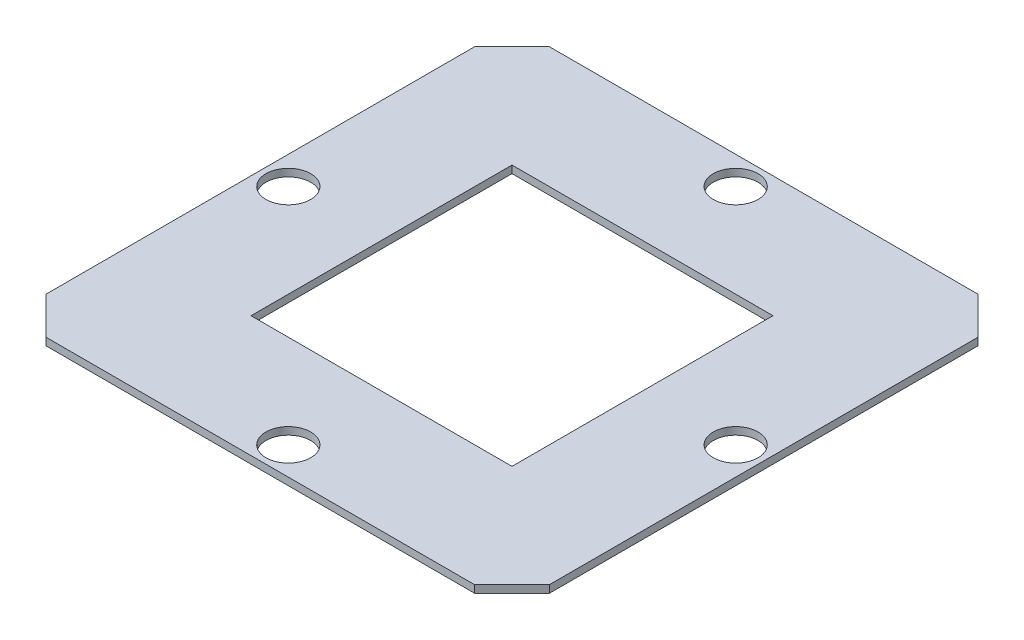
from build123d import *

# Parameters (mm, degrees)
SKETCH1_W          = 135
SKETCH1_H          = 135
EXTRUDE1_DEPTH     = 2
SKETCH2_R          = 6
CUT_EXTRUDE1_DEPTH = 96.480364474
CHAMFER1_SIZE      = 10
CUT_EXTRUDE2_REACH = 97.48
SKETCH3_W          = 70
SKETCH3_H          = 70


with BuildPart() as part:
    # Sketch1 → Extrude1 (new body)
    with BuildSketch(Plane(origin=(0, 0, 0), x_dir=(1, 0, 0), z_dir=(0, 1, 0))):
        Rectangle(SKETCH1_W, SKETCH1_H)
    extrude(amount=EXTRUDE1_DEPTH)

    # Sketch2 → Cut-Extrude1 (cut, through all)
    with BuildSketch(Plane(origin=(0, 2, 0), x_dir=(1, 0, 0), z_dir=(0, 1, 0))):
        with Locations(Location((0, 60, 0), (0, 0, 270))):
            Circle(SKETCH2_R)
        with Locations(Location((60, 0, 0), (0, 0, 270))):
            Circle(SKETCH2_R)
        with Locations(Location((0, -60, 0), (0, 0, 270))):
            Circle(SKETCH2_R)
        with Locations(Location((-60, 0, 0), (0, 0, 270))):
            Circle(SKETCH2_R)
    extrude(amount=-CUT_EXTRUDE1_DEPTH, mode=Mode.SUBTRACT)

    # Chamfer1
    chamfer1_edges = [part.edges().sort_by_distance(p)[0] for p in [
        (67.5, 1, -67.5),
        (67.5, 1, 67.5),
        (-67.5, 1, 67.5),
        (-67.5, 1, -67.5),
    ]]
    chamfer(chamfer1_edges, length=CHAMFER1_SIZE)

    # Sketch3 → Cut-Extrude2 (cut, up to next)
    with BuildSketch(Plane.XZ, mode=Mode.PRIVATE) as cut_extrude2_sk1:
        Rectangle(SKETCH3_W, SKETCH3_H)
    cut_extrude2_tool1 = extrude(cut_extrude2_sk1.sketch, amount=-CUT_EXTRUDE2_REACH, mode=Mode.PRIVATE) & part.part
    add(cut_extrude2_tool1.solids().sort_by_distance((0, 0, 0))[0], mode=Mode.SUBTRACT)


solid = part.part
